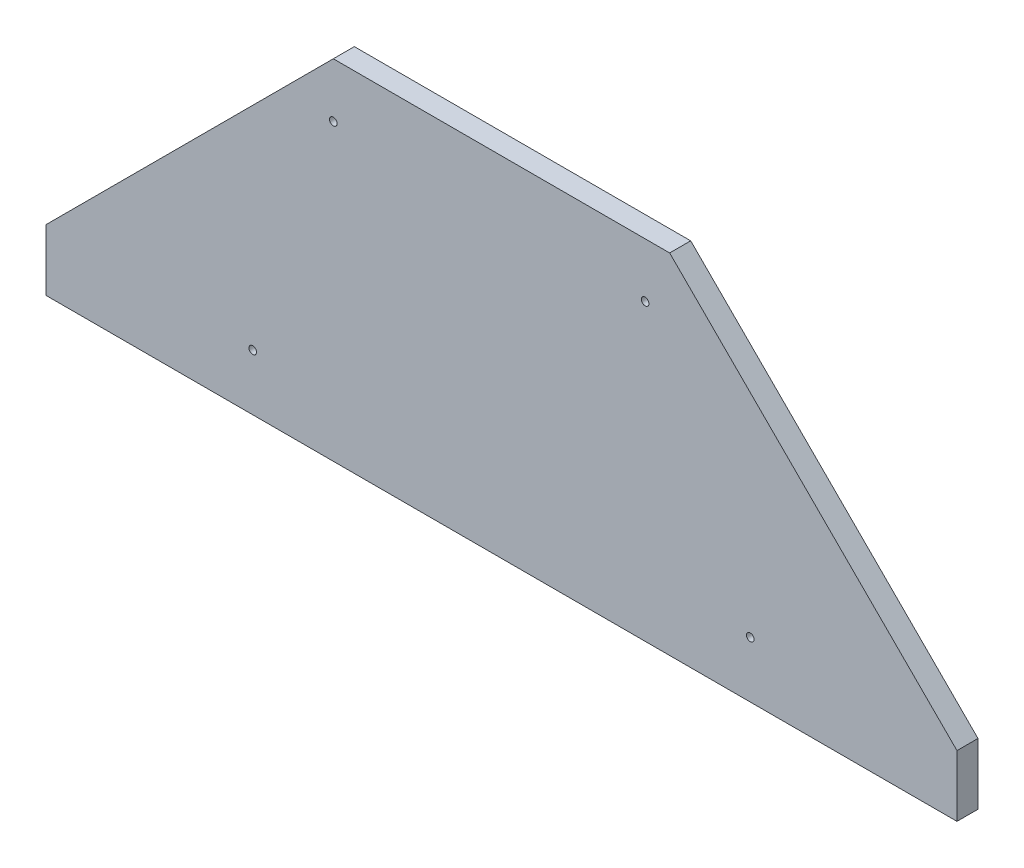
from build123d import *

# Parameters (mm, degrees)
SKETCH1_R      = 3.429
EXTRUDE1_DEPTH = 9.525


with BuildPart() as part:
    # Sketch1 → Extrude1 (new, symmetric)
    with BuildSketch(Plane.XY):
        Polygon((412.75, -102.39375), (152.4, 157.95625), (-152.4, 157.95625), (-412.75, -102.39375), (-412.75, -157.95625), (412.75, -157.95625), align=None)
        with Locations(Location((-225.425, -107.15625, 0), (0, 0, 180))):
            Circle(SKETCH1_R, mode=Mode.SUBTRACT)
        with Locations(Location((225.425, -107.15625, 0), (0, 0, 180))):
            Circle(SKETCH1_R, mode=Mode.SUBTRACT)
        with Locations(Location((-152.4, 108.74375, 0), (0, 0, 180))):
            Circle(SKETCH1_R, mode=Mode.SUBTRACT)
        with Locations(Location((130.175, 108.74375, 0), (0, 0, 180))):
            Circle(SKETCH1_R, mode=Mode.SUBTRACT)
    extrude(amount=EXTRUDE1_DEPTH, both=True)


solid = part.part
